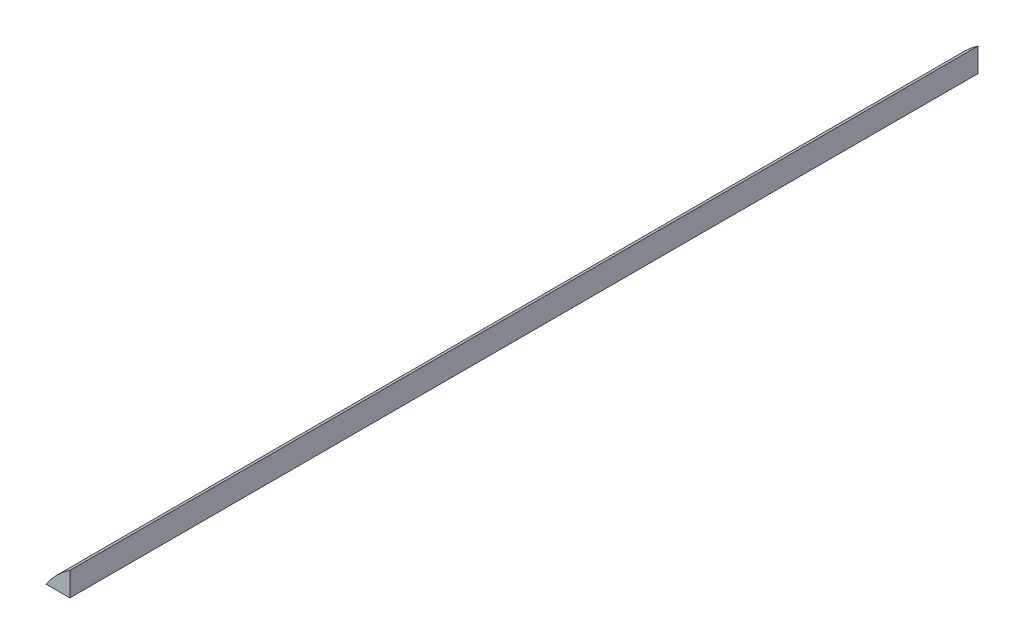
from build123d import *

# Parameters (mm, degrees)
SKETCH1_R          = 19.05
EXTRUDE1_DEPTH     = 203.2
CUT_EXTRUDE1_DEPTH = 205.978157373
SKETCH5_OUTSIDE_W  = 74.918
SKETCH5_OUTSIDE_H  = 51.688
CUT_EXTRUDE2_DEPTH = 205.707494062


with BuildPart() as part:
    # Sketch1 → Extrude1 (new body)
    with BuildSketch(Plane.XY):
        Circle(SKETCH1_R)
    extrude(amount=EXTRUDE1_DEPTH)

    # Sketch2 → Cut-Extrude1 (cut, through all)
    with BuildSketch(Plane.XY.offset(203.2)):
        with BuildLine():
            Line((-15.875, 10.530283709), (15.875, 10.530283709))
            ThreePointArc((15.875, 10.530283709), (0, -19.05), (-15.875, 10.530283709))
        make_face()
    extrude(amount=-CUT_EXTRUDE1_DEPTH, mode=Mode.SUBTRACT)

    # Sketch5 outside → Cut-Extrude2 (cut, through all)
    with BuildSketch(Plane.XY.offset(203.2)):
        with Locations((0, 14.79)):
            Rectangle(SKETCH5_OUTSIDE_W, SKETCH5_OUTSIDE_H)
        with BuildLine():
            Line((-15.875, 10.530283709), (-10.541, 10.530283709))
            Line((-10.541, 10.530283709), (-10.541, 15.867886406))
            ThreePointArc((-10.541, 15.867886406), (-13.47493097, 13.465835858), (-15.875, 10.530283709))
        make_face(mode=Mode.SUBTRACT)
    extrude(amount=-CUT_EXTRUDE2_DEPTH, mode=Mode.SUBTRACT)


solid = part.part
